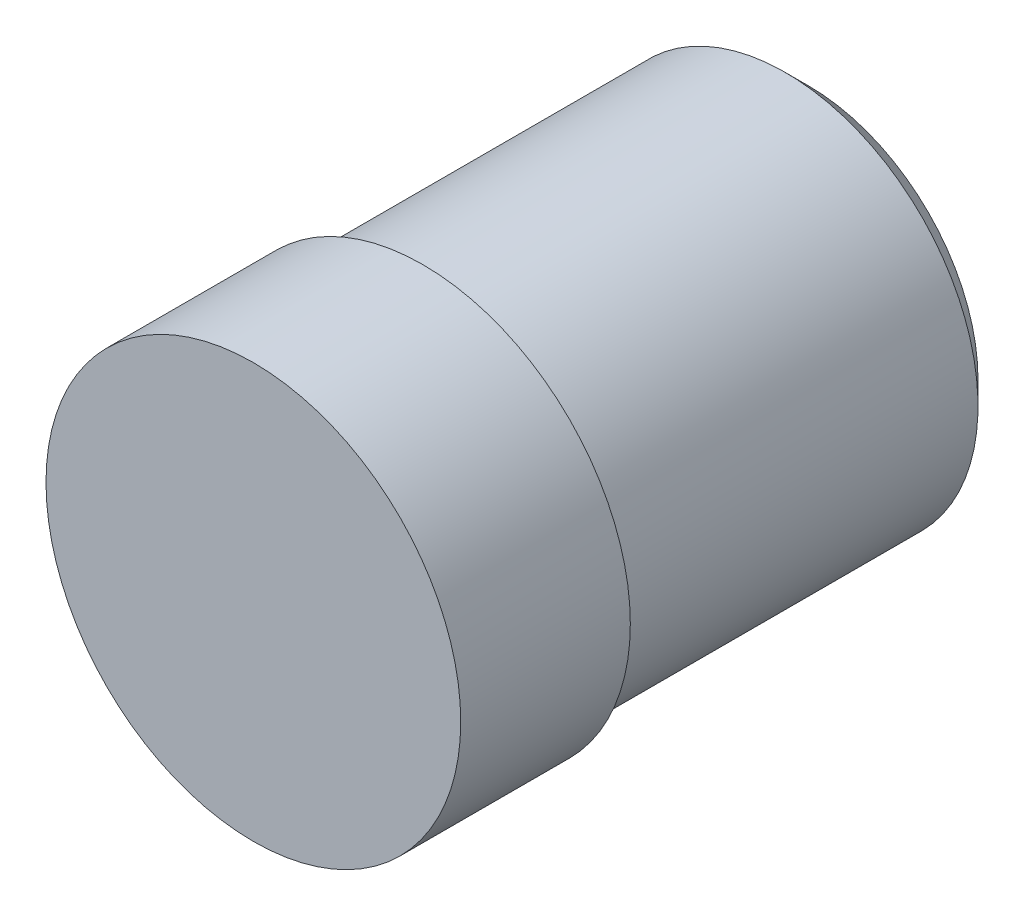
from build123d import *


with BuildPart() as part:
    # Esquisse1 → Base-R_volution (revolve)
    with BuildSketch(Plane(origin=(0, 0, 0), x_dir=(1, 0, 0), z_dir=(0, 1, 0))):
        Polygon((0, 0), (-26.9, 0), (-26.9, 22), (-25, 22), (-25, 69), (-22, 72), (0, 72), align=None)
    revolve(axis=Axis((0, 0, -61.832120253), (0, 0, 1)))


solid = part.part
